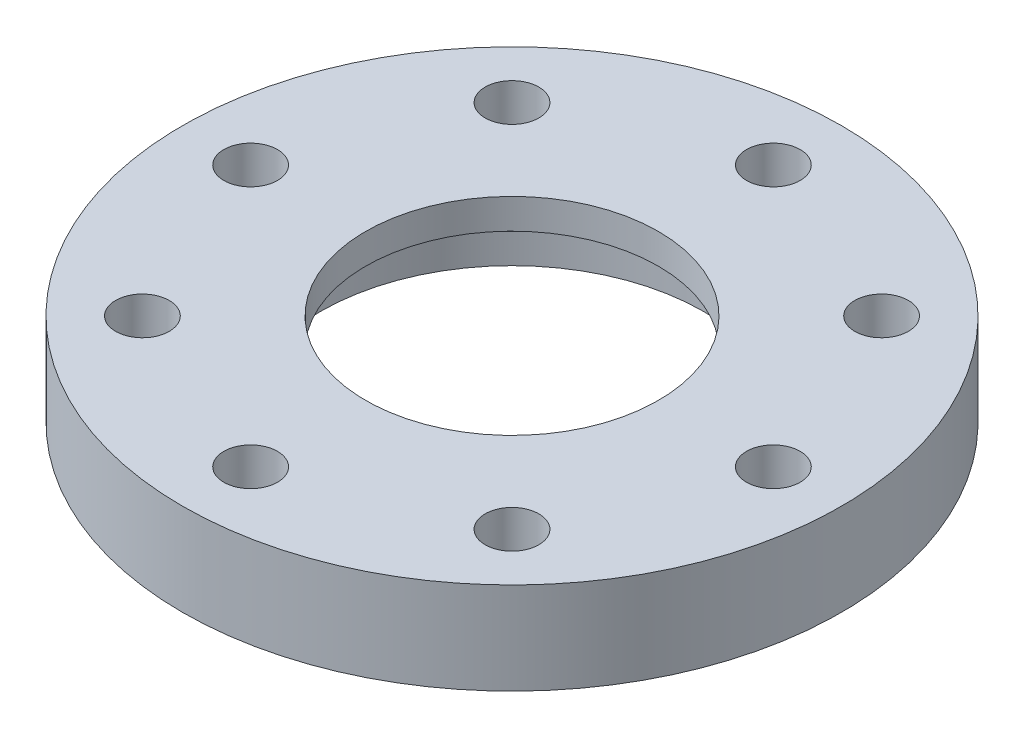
from build123d import *

# Parameters (mm, degrees)
CROQUIS4_R            = 3.5
CORTAR_EXTRUIR1_DEPTH = 62.983868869
MATRIZC1_COUNT        = 8


with BuildPart() as part:
    # Croquis3 → Revoluci_n1 (revolve)
    with BuildSketch(Plane.XY, mode=Mode.PRIVATE) as revoluci_n1_sk:
        Polygon((-43, 37.683500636), (-19.1, 37.683500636), (-19.1, 33.754725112), (-25, 29.623500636), (-25, 25.683500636), (-43, 25.683500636), align=None)
    revolve(revoluci_n1_sk.sketch.rotate(Axis((0, 0, 0), (0, 1, 0)), 270), axis=Axis((0, 0, 0), (0, 1, 0)))

    # Croquis4 → Cortar-Extruir1 (cut, through all)
    with BuildSketch(Plane(origin=(0, 37.683500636, 0), x_dir=(1, 0, 0), z_dir=(0, 1, 0))):
        with Locations(Location((0, 34.1, 0), (0, 0, 270))):
            Circle(CROQUIS4_R)
    cortar_extruir1 = extrude(amount=-CORTAR_EXTRUIR1_DEPTH, mode=Mode.SUBTRACT)

    # MatrizC1: Cortar-Extruir1 ×8 about axis
    matrizc1_axis = Axis((0, 0, 0), (0, 1, 0))
    for i in range(1, MATRIZC1_COUNT):
        add(cortar_extruir1.rotate(matrizc1_axis, i * 360 / MATRIZC1_COUNT), mode=Mode.SUBTRACT)


solid = part.part
